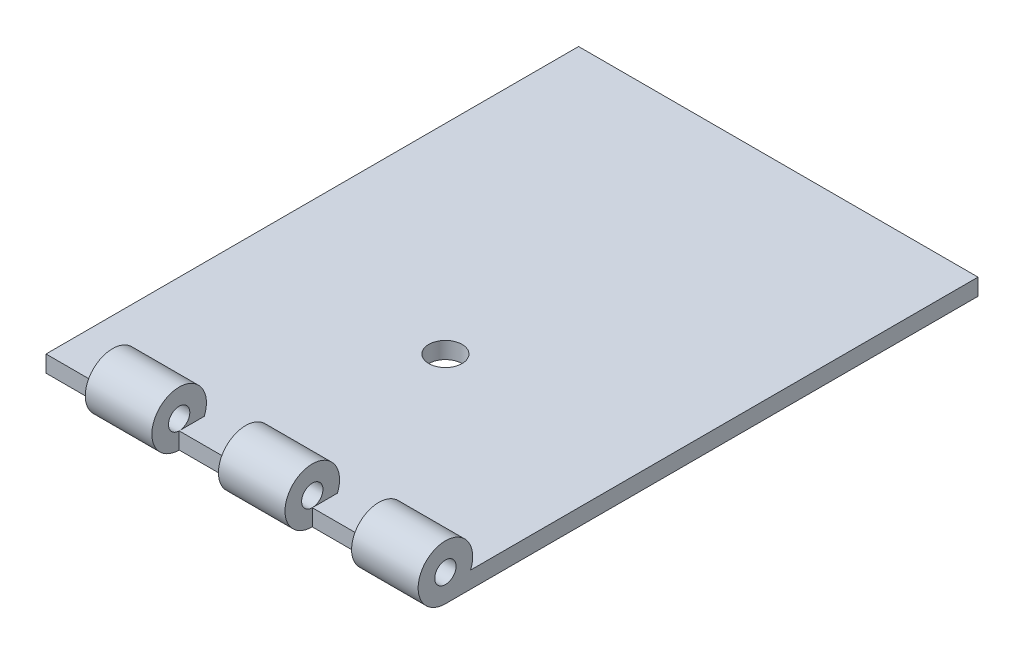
from build123d import *

# Parameters (mm, degrees)
SKETCH1_W               = 38.1
SKETCH1_H               = 50.8
BOSS_EXTRUDE1_DEPTH     = 1.5875
SKETCH2_R               = 2.6035
SKETCH2_R_2             = 1.016
BOSS_EXTRUDE2_DEPTH     = 6.35
LPATTERN1_COUNT         = 3
LPATTERN1_PITCH         = 12.7
CUT_EXTRUDE1_DEPTH      = 46.086341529
CUT_EXTRUDE1_DEPTH_BACK = 46.086341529
SKETCH5_R               = 1.5875


with BuildPart() as part:
    # Sketch1 → Boss-Extrude1 (new body)
    with BuildSketch(Plane(origin=(0, 0, 0), x_dir=(1, 0, 0), z_dir=(0, 1, 0))):
        with Locations((0, -12.7)):
            Rectangle(SKETCH1_W, SKETCH1_H)
    extrude(amount=BOSS_EXTRUDE1_DEPTH)

    # Sketch2 → Boss-Extrude2 (add)
    with BuildSketch(Plane(origin=(19.05, 0, 0), x_dir=(0, 0, -1), z_dir=(1, 0, 0))):
        with Locations((-38.1, 2.6035)):
            Circle(SKETCH2_R)
        with Locations((-38.1, 2.6035)):
            Circle(SKETCH2_R_2, mode=Mode.SUBTRACT)
    boss_extrude2 = extrude(amount=-BOSS_EXTRUDE2_DEPTH)

    # LPattern1: Boss-Extrude2 ×3
    with Locations(*[(-i * LPATTERN1_PITCH, 0, 0) for i in range(1, LPATTERN1_COUNT)]):
        add(boss_extrude2)

    # Sketch5 → Cut-Extrude1 (cut, two sides: drawn at the far end of the back side and taken through both)
    with BuildSketch(Plane(origin=(0, 1.5875, 0), x_dir=(1, 0, 0), z_dir=(0, 1, 0)).offset(-CUT_EXTRUDE1_DEPTH_BACK)):
        with Locations((0, 25.4)):
            Circle(SKETCH5_R)
        with Locations(Location((0, -19.05, 0), (0, 0, 270))):
            Circle(SKETCH5_R)
    extrude(amount=CUT_EXTRUDE1_DEPTH + CUT_EXTRUDE1_DEPTH_BACK, mode=Mode.SUBTRACT)


solid = part.part
